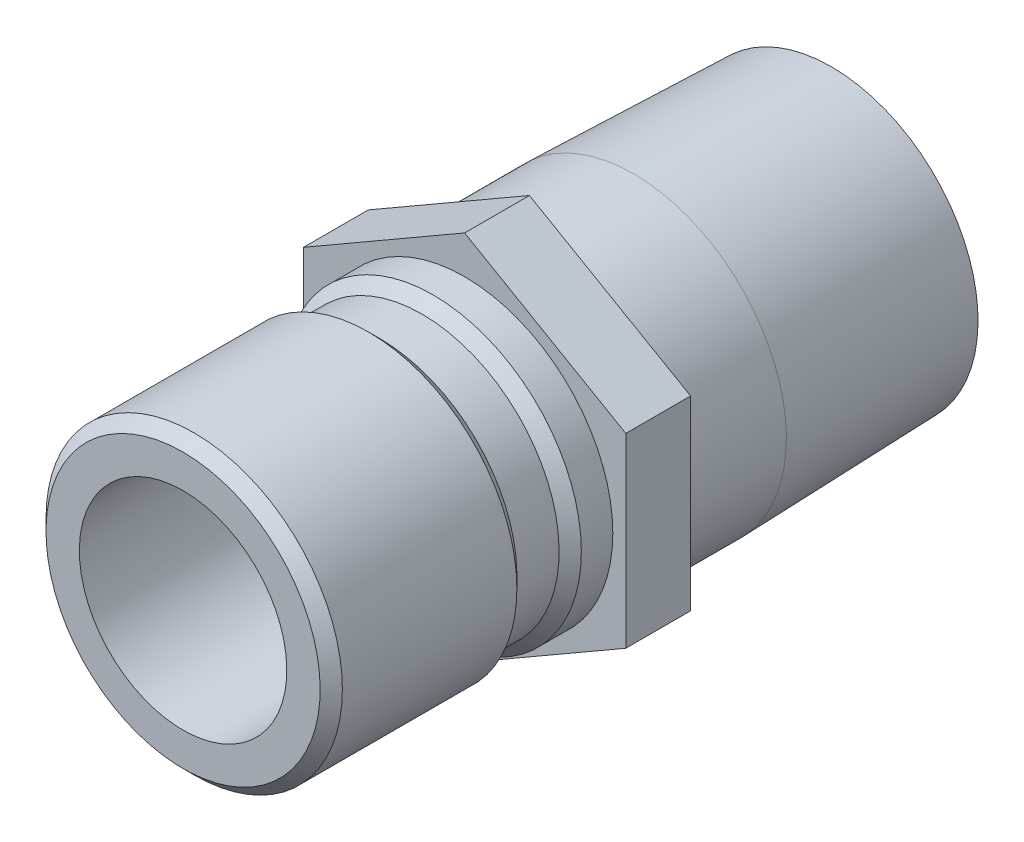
from build123d import *

# Parameters (mm, degrees)
SKETCH2_R           = 7.8994
BOSS_EXTRUDE1_DEPTH = 4.445


with BuildPart() as part:
    # Sketch1 → Revolve1 (revolve)
    with BuildSketch(Plane(origin=(0, 0, 0), x_dir=(0, 0, -1), z_dir=(1, 0, 0))):
        Polygon((-19.304, 7.112), (-19.304, 9.398), (-18.542, 10.16), (-6.5786, 10.16), (-5.8166, 9.398), (-2.921, 9.398), (-2.159, 10.16), (0, 10.16), (0, 10.4775), (11.5824, 10.4775), (25.146, 10.053640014), (25.146, 7.8994), (-1.105331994, 7.8994), (-1.524, 7.112), align=None)
    revolve(axis=Axis((0, 0, 0), (0, 0, 1)))

    # Sketch2 → Boss-Extrude1 (add)
    with BuildSketch(Plane.XY):
        Polygon((-11.049, 6.379143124), (-11.049, -6.379143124), (0, -12.758286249), (11.049, -6.379143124), (11.049, 6.379143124), (0, 12.758286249), align=None)
        with Locations(Location((0, 0, 0), (0, 0, 90))):
            Circle(SKETCH2_R, mode=Mode.SUBTRACT)
    extrude(amount=-BOSS_EXTRUDE1_DEPTH)


solid = part.part
